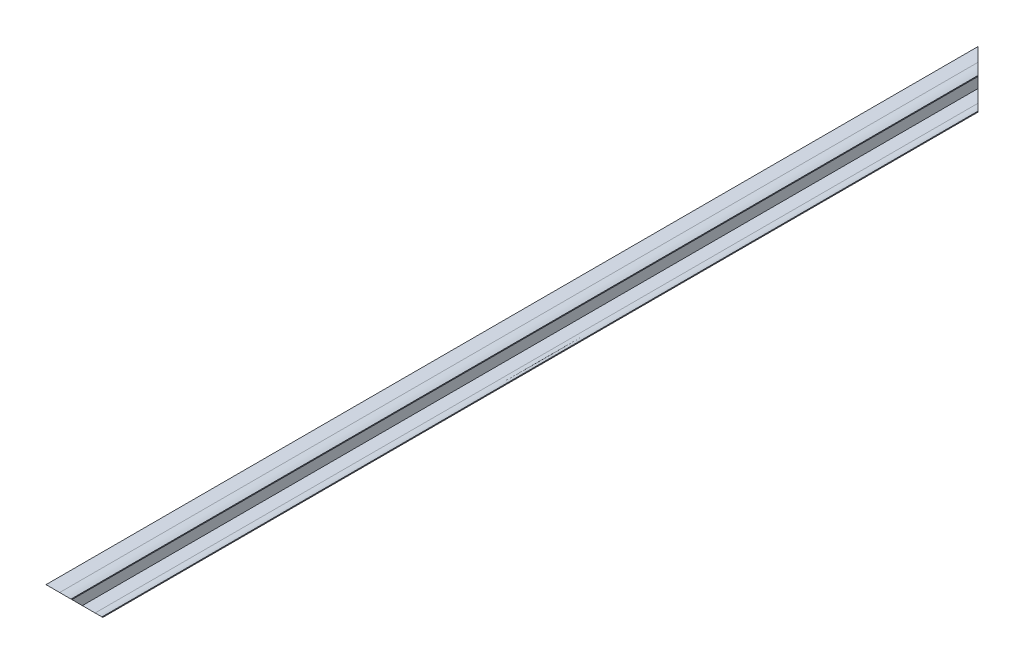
from build123d import *

# Parameters (mm, degrees)
EXTRUSION1_DEPTH = 2050
EXTRUSION4_REACH = 2054.17
EXTRUSION5_REACH = 2054.17


with BuildPart() as part:
    # Esquisse1 → Extrusion1 (new body)
    with BuildSketch(Plane.XY):
        with BuildLine():
            Line((0, 0), (0, 80))
            Line((0, 80), (30, 80))
            add(Edge.make_bspline(
                [(30, 80), (40.603281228, 79.951543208), (50, 75)],
                knots=[0, 0, 0, 1, 1, 1], degree=2))
            Line((50, 75), (50, 73))
            add(Edge.make_bspline(
                [(30, 78), (40.603281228, 77.951543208), (50, 73)],
                knots=[0, 0, 0, 1, 1, 1], degree=2))
            Line((30, 78), (2, 78))
            Line((2, 78), (2, 2))
            Line((2, 2), (30, 2))
            add(Edge.make_bspline(
                [(30, 2), (40.603281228, 2.048456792), (50, 7)],
                knots=[0, 0, 0, 1, 1, 1], degree=2))
            Line((50, 7), (50, 5))
            add(Edge.make_bspline(
                [(30, 0), (40.603281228, 0.048456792), (50, 5)],
                knots=[0, 0, 0, 1, 1, 1], degree=2))
            Line((30, 0), (0, 0))
        make_face()
    extrude(amount=EXTRUSION1_DEPTH)

    # Esquisse3 → Extrusion4 (cut, up to next)
    with BuildSketch(Plane(origin=(0, 80, 0), x_dir=(-1, 0, 0), z_dir=(0, 1, 0)), mode=Mode.PRIVATE) as extrusion4_sk1:
        Polygon((0, 0), (-50, 50), (-50, 0), align=None)
    extrusion4_tool1 = extrude(extrusion4_sk1.sketch, amount=-EXTRUSION4_REACH, mode=Mode.PRIVATE) & part.part
    add(extrusion4_tool1.solids().sort_by_distance((33.333333, 80, 16.666667))[0], mode=Mode.SUBTRACT)

    # Esquisse4 → Extrusion5 (cut, up to next)
    with BuildSketch(Plane.ZY, mode=Mode.PRIVATE) as extrusion5_sk1:
        Polygon((2050, 80), (1970, 0), (2050, 0), align=None)
    extrusion5_tool1 = extrude(extrusion5_sk1.sketch, amount=-EXTRUSION5_REACH, mode=Mode.PRIVATE) & part.part
    add(extrusion5_tool1.solids().sort_by_distance((0, 26.666667, 2023.333333))[0], mode=Mode.SUBTRACT)


solid = part.part
